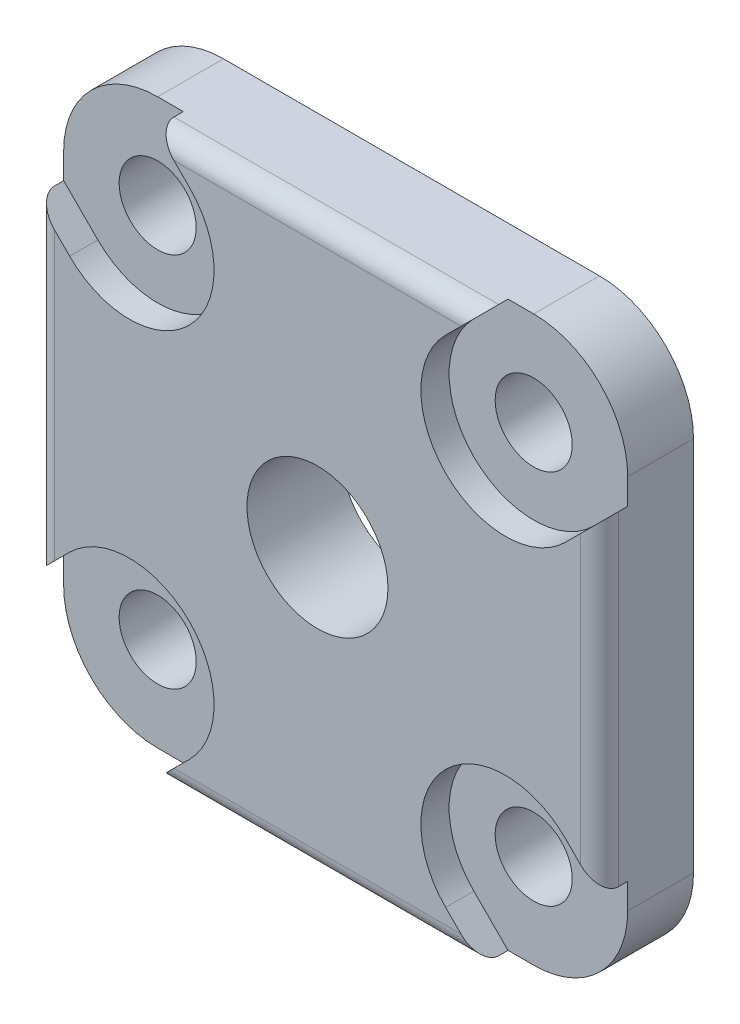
ISO-10303-21;
HEADER;
FILE_DESCRIPTION(('STEP AP214'),'2;1');
FILE_NAME('part.step','',(''),(''),'','','');
FILE_SCHEMA(('AUTOMOTIVE_DESIGN { 1 0 10303 214 1 1 1 1 }'));
ENDSEC;
DATA;
#1=APPLICATION_CONTEXT('core data for automotive mechanical design processes');
#2=APPLICATION_PROTOCOL_DEFINITION('international standard','automotive_design',2000,#1);
#3=PRODUCT_CONTEXT('',#1,'mechanical');
#4=PRODUCT('Part','Part','',(#3));
#5=PRODUCT_RELATED_PRODUCT_CATEGORY('part','',(#4));
#6=PRODUCT_DEFINITION_FORMATION('','',#4);
#7=PRODUCT_DEFINITION_CONTEXT('part definition',#1,'design');
#8=PRODUCT_DEFINITION('design','',#6,#7);
#9=PRODUCT_DEFINITION_SHAPE('','',#8);
#10=(LENGTH_UNIT() NAMED_UNIT(*) SI_UNIT(.MILLI.,.METRE.));
#11=(NAMED_UNIT(*) PLANE_ANGLE_UNIT() SI_UNIT($,.RADIAN.));
#12=(NAMED_UNIT(*) SI_UNIT($,.STERADIAN.) SOLID_ANGLE_UNIT());
#13=UNCERTAINTY_MEASURE_WITH_UNIT(LENGTH_MEASURE(1.E-05),#10,'distance_accuracy_value','');
#14=(GEOMETRIC_REPRESENTATION_CONTEXT(3) GLOBAL_UNCERTAINTY_ASSIGNED_CONTEXT((#13)) GLOBAL_UNIT_ASSIGNED_CONTEXT((#10,
#11,#12)) REPRESENTATION_CONTEXT('',''));
#15=CARTESIAN_POINT('',(0.,0.,0.));
#16=DIRECTION('',(0.,0.,1.));
#17=DIRECTION('',(1.,0.,0.));
#18=AXIS2_PLACEMENT_3D('',#15,#16,#17);
#19=CARTESIAN_POINT('',(-19.9999999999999,-30.,5.));
#20=DIRECTION('',(0.,1.,0.));
#21=DIRECTION('',(0.,0.,1.));
#22=AXIS2_PLACEMENT_3D('',#19,#20,#21);
#23=PLANE('',#22);
#24=DIRECTION('',(0.,0.,1.));
#25=VECTOR('',#24,1.);
#26=CARTESIAN_POINT('',(17.2720779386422,-30.,2.));
#27=LINE('',#26,#25);
#28=CARTESIAN_POINT('',(17.2720779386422,-30.,2.));
#29=VERTEX_POINT('',#28);
#30=CARTESIAN_POINT('',(17.2720779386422,-30.,3.));
#31=VERTEX_POINT('',#30);
#32=EDGE_CURVE('E888',#29,#31,#27,.T.);
#33=ORIENTED_EDGE('',*,*,#32,.T.);
#34=DIRECTION('',(1.,0.,0.));
#35=VECTOR('',#34,1.);
#36=CARTESIAN_POINT('',(-17.2720779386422,-30.,3.));
#37=LINE('',#36,#35);
#38=CARTESIAN_POINT('',(-17.2720779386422,-30.,3.));
#39=VERTEX_POINT('',#38);
#40=EDGE_CURVE('E1012',#31,#39,#37,.F.);
#41=ORIENTED_EDGE('',*,*,#40,.T.);
#42=DIRECTION('',(0.,0.,1.));
#43=VECTOR('',#42,1.);
#44=CARTESIAN_POINT('',(-17.2720779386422,-30.,2.));
#45=LINE('',#44,#43);
#46=CARTESIAN_POINT('',(-17.2720779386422,-30.,2.));
#47=VERTEX_POINT('',#46);
#48=EDGE_CURVE('E812',#47,#39,#45,.T.);
#49=ORIENTED_EDGE('',*,*,#48,.F.);
#50=DIRECTION('',(-1.,0.,0.));
#51=VECTOR('',#50,1.);
#52=CARTESIAN_POINT('',(-19.9999999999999,-30.,2.));
#53=LINE('',#52,#51);
#54=CARTESIAN_POINT('',(-19.9999999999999,-30.,2.));
#55=VERTEX_POINT('',#54);
#56=EDGE_CURVE('E803',#47,#55,#53,.T.);
#57=ORIENTED_EDGE('',*,*,#56,.T.);
#58=DIRECTION('',(0.,0.,-1.));
#59=VECTOR('',#58,1.);
#60=CARTESIAN_POINT('',(-19.9999999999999,-30.,5.));
#61=LINE('',#60,#59);
#62=CARTESIAN_POINT('',(-19.9999999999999,-30.,-5.));
#63=VERTEX_POINT('',#62);
#64=EDGE_CURVE('E982',#55,#63,#61,.T.);
#65=ORIENTED_EDGE('',*,*,#64,.T.);
#66=DIRECTION('',(1.,0.,0.));
#67=VECTOR('',#66,1.);
#68=CARTESIAN_POINT('',(-19.9999999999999,-30.,-5.));
#69=LINE('',#68,#67);
#70=CARTESIAN_POINT('',(19.9999999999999,-30.,-5.));
#71=VERTEX_POINT('',#70);
#72=EDGE_CURVE('E947',#63,#71,#69,.T.);
#73=ORIENTED_EDGE('',*,*,#72,.T.);
#74=DIRECTION('',(0.,0.,-1.));
#75=VECTOR('',#74,1.);
#76=CARTESIAN_POINT('',(19.9999999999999,-30.,5.));
#77=LINE('',#76,#75);
#78=CARTESIAN_POINT('',(19.9999999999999,-30.,2.));
#79=VERTEX_POINT('',#78);
#80=EDGE_CURVE('E980',#79,#71,#77,.T.);
#81=ORIENTED_EDGE('',*,*,#80,.F.);
#82=DIRECTION('',(1.,0.,0.));
#83=VECTOR('',#82,1.);
#84=CARTESIAN_POINT('',(19.9999999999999,-30.,2.));
#85=LINE('',#84,#83);
#86=EDGE_CURVE('E862',#29,#79,#85,.T.);
#87=ORIENTED_EDGE('',*,*,#86,.F.);
#88=EDGE_LOOP('',(#33,#41,#49,#57,#65,#73,#81,#87));
#89=FACE_BOUND('',#88,.T.);
#90=ADVANCED_FACE('F592',(#89),#23,.F.);
#91=CARTESIAN_POINT('',(-30.,19.9999999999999,5.));
#92=DIRECTION('',(1.,0.,0.));
#93=DIRECTION('',(0.,1.,0.));
#94=AXIS2_PLACEMENT_3D('',#91,#92,#93);
#95=PLANE('',#94);
#96=DIRECTION('',(0.,0.,1.));
#97=VECTOR('',#96,1.);
#98=CARTESIAN_POINT('',(-30.,-17.2720779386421,2.));
#99=LINE('',#98,#97);
#100=CARTESIAN_POINT('',(-30.,-17.2720779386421,2.));
#101=VERTEX_POINT('',#100);
#102=CARTESIAN_POINT('',(-30.,-17.2720779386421,3.));
#103=VERTEX_POINT('',#102);
#104=EDGE_CURVE('E783',#101,#103,#99,.T.);
#105=ORIENTED_EDGE('',*,*,#104,.T.);
#106=DIRECTION('',(0.,-1.,0.));
#107=VECTOR('',#106,1.);
#108=CARTESIAN_POINT('',(-30.,17.2720779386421,3.));
#109=LINE('',#108,#107);
#110=CARTESIAN_POINT('',(-30.,17.2720779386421,3.));
#111=VERTEX_POINT('',#110);
#112=EDGE_CURVE('E1006',#103,#111,#109,.F.);
#113=ORIENTED_EDGE('',*,*,#112,.T.);
#114=DIRECTION('',(0.,0.,1.));
#115=VECTOR('',#114,1.);
#116=CARTESIAN_POINT('',(-30.,17.2720779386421,2.));
#117=LINE('',#116,#115);
#118=CARTESIAN_POINT('',(-30.,17.2720779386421,2.));
#119=VERTEX_POINT('',#118);
#120=EDGE_CURVE('E840',#119,#111,#117,.T.);
#121=ORIENTED_EDGE('',*,*,#120,.F.);
#122=DIRECTION('',(0.,-1.,0.));
#123=VECTOR('',#122,1.);
#124=CARTESIAN_POINT('',(-30.,17.2720779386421,2.));
#125=LINE('',#124,#123);
#126=CARTESIAN_POINT('',(-30.,19.9999999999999,2.));
#127=VERTEX_POINT('',#126);
#128=EDGE_CURVE('E824',#127,#119,#125,.T.);
#129=ORIENTED_EDGE('',*,*,#128,.F.);
#130=DIRECTION('',(0.,0.,-1.));
#131=VECTOR('',#130,1.);
#132=CARTESIAN_POINT('',(-30.,19.9999999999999,5.));
#133=LINE('',#132,#131);
#134=CARTESIAN_POINT('',(-30.,19.9999999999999,-5.));
#135=VERTEX_POINT('',#134);
#136=EDGE_CURVE('E970',#127,#135,#133,.T.);
#137=ORIENTED_EDGE('',*,*,#136,.T.);
#138=DIRECTION('',(0.,-1.,0.));
#139=VECTOR('',#138,1.);
#140=CARTESIAN_POINT('',(-30.,19.9999999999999,-5.));
#141=LINE('',#140,#139);
#142=CARTESIAN_POINT('',(-30.,-19.9999999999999,-5.));
#143=VERTEX_POINT('',#142);
#144=EDGE_CURVE('E965',#135,#143,#141,.T.);
#145=ORIENTED_EDGE('',*,*,#144,.T.);
#146=DIRECTION('',(0.,0.,-1.));
#147=VECTOR('',#146,1.);
#148=CARTESIAN_POINT('',(-30.,-19.9999999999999,5.));
#149=LINE('',#148,#147);
#150=CARTESIAN_POINT('',(-30.,-19.9999999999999,2.));
#151=VERTEX_POINT('',#150);
#152=EDGE_CURVE('E968',#151,#143,#149,.T.);
#153=ORIENTED_EDGE('',*,*,#152,.F.);
#154=DIRECTION('',(0.,1.,0.));
#155=VECTOR('',#154,1.);
#156=CARTESIAN_POINT('',(-30.,-17.2720779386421,2.));
#157=LINE('',#156,#155);
#158=EDGE_CURVE('E788',#151,#101,#157,.T.);
#159=ORIENTED_EDGE('',*,*,#158,.T.);
#160=EDGE_LOOP('',(#105,#113,#121,#129,#137,#145,#153,#159));
#161=FACE_BOUND('',#160,.T.);
#162=ADVANCED_FACE('F1077',(#161),#95,.F.);
#163=CARTESIAN_POINT('',(30.,19.9999999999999,5.));
#164=DIRECTION('',(-1.,0.,0.));
#165=DIRECTION('',(0.,-1.,0.));
#166=AXIS2_PLACEMENT_3D('',#163,#164,#165);
#167=PLANE('',#166);
#168=DIRECTION('',(0.,0.,1.));
#169=VECTOR('',#168,1.);
#170=CARTESIAN_POINT('',(30.,17.2720779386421,2.));
#171=LINE('',#170,#169);
#172=CARTESIAN_POINT('',(30.,17.2720779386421,2.));
#173=VERTEX_POINT('',#172);
#174=CARTESIAN_POINT('',(30.,17.2720779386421,3.));
#175=VERTEX_POINT('',#174);
#176=EDGE_CURVE('E922',#173,#175,#171,.T.);
#177=ORIENTED_EDGE('',*,*,#176,.T.);
#178=DIRECTION('',(0.,1.,0.));
#179=VECTOR('',#178,1.);
#180=CARTESIAN_POINT('',(30.,-17.2720779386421,3.));
#181=LINE('',#180,#179);
#182=CARTESIAN_POINT('',(30.,-17.2720779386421,3.));
#183=VERTEX_POINT('',#182);
#184=EDGE_CURVE('E1018',#175,#183,#181,.F.);
#185=ORIENTED_EDGE('',*,*,#184,.T.);
#186=DIRECTION('',(0.,0.,1.));
#187=VECTOR('',#186,1.);
#188=CARTESIAN_POINT('',(30.,-17.2720779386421,2.));
#189=LINE('',#188,#187);
#190=CARTESIAN_POINT('',(30.,-17.2720779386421,2.));
#191=VERTEX_POINT('',#190);
#192=EDGE_CURVE('E873',#191,#183,#189,.T.);
#193=ORIENTED_EDGE('',*,*,#192,.F.);
#194=DIRECTION('',(0.,1.,0.));
#195=VECTOR('',#194,1.);
#196=CARTESIAN_POINT('',(30.,-17.2720779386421,2.));
#197=LINE('',#196,#195);
#198=CARTESIAN_POINT('',(30.,-19.9999999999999,2.));
#199=VERTEX_POINT('',#198);
#200=EDGE_CURVE('E857',#199,#191,#197,.T.);
#201=ORIENTED_EDGE('',*,*,#200,.F.);
#202=DIRECTION('',(0.,0.,-1.));
#203=VECTOR('',#202,1.);
#204=CARTESIAN_POINT('',(30.,-19.9999999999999,5.));
#205=LINE('',#204,#203);
#206=CARTESIAN_POINT('',(30.,-19.9999999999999,-5.));
#207=VERTEX_POINT('',#206);
#208=EDGE_CURVE('E978',#199,#207,#205,.T.);
#209=ORIENTED_EDGE('',*,*,#208,.T.);
#210=DIRECTION('',(0.,1.,0.));
#211=VECTOR('',#210,1.);
#212=CARTESIAN_POINT('',(30.,19.9999999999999,-5.));
#213=LINE('',#212,#211);
#214=CARTESIAN_POINT('',(30.,19.9999999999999,-5.));
#215=VERTEX_POINT('',#214);
#216=EDGE_CURVE('E953',#207,#215,#213,.T.);
#217=ORIENTED_EDGE('',*,*,#216,.T.);
#218=DIRECTION('',(0.,0.,-1.));
#219=VECTOR('',#218,1.);
#220=CARTESIAN_POINT('',(30.,19.9999999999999,5.));
#221=LINE('',#220,#219);
#222=CARTESIAN_POINT('',(30.,19.9999999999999,2.));
#223=VERTEX_POINT('',#222);
#224=EDGE_CURVE('E976',#223,#215,#221,.T.);
#225=ORIENTED_EDGE('',*,*,#224,.F.);
#226=DIRECTION('',(0.,-1.,0.));
#227=VECTOR('',#226,1.);
#228=CARTESIAN_POINT('',(30.,17.2720779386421,2.));
#229=LINE('',#228,#227);
#230=EDGE_CURVE('E892',#223,#173,#229,.T.);
#231=ORIENTED_EDGE('',*,*,#230,.T.);
#232=EDGE_LOOP('',(#177,#185,#193,#201,#209,#217,#225,#231));
#233=FACE_BOUND('',#232,.T.);
#234=ADVANCED_FACE('F1043',(#233),#167,.F.);
#235=CARTESIAN_POINT('',(-19.9999999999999,30.,5.));
#236=DIRECTION('',(0.,-1.,0.));
#237=DIRECTION('',(0.,0.,-1.));
#238=AXIS2_PLACEMENT_3D('',#235,#236,#237);
#239=PLANE('',#238);
#240=DIRECTION('',(0.,0.,1.));
#241=VECTOR('',#240,1.);
#242=CARTESIAN_POINT('',(-17.2720779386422,30.,2.));
#243=LINE('',#242,#241);
#244=CARTESIAN_POINT('',(-17.2720779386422,30.,2.));
#245=VERTEX_POINT('',#244);
#246=CARTESIAN_POINT('',(-17.2720779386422,30.,3.));
#247=VERTEX_POINT('',#246);
#248=EDGE_CURVE('E854',#245,#247,#243,.T.);
#249=ORIENTED_EDGE('',*,*,#248,.T.);
#250=DIRECTION('',(-1.,0.,0.));
#251=VECTOR('',#250,1.);
#252=CARTESIAN_POINT('',(17.2720779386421,30.,3.));
#253=LINE('',#252,#251);
#254=CARTESIAN_POINT('',(17.2720779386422,30.,3.));
#255=VERTEX_POINT('',#254);
#256=EDGE_CURVE('E600',#247,#255,#253,.F.);
#257=ORIENTED_EDGE('',*,*,#256,.T.);
#258=DIRECTION('',(0.,0.,1.));
#259=VECTOR('',#258,1.);
#260=CARTESIAN_POINT('',(17.2720779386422,30.,2.));
#261=LINE('',#260,#259);
#262=CARTESIAN_POINT('',(17.2720779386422,30.,2.));
#263=VERTEX_POINT('',#262);
#264=EDGE_CURVE('E908',#263,#255,#261,.T.);
#265=ORIENTED_EDGE('',*,*,#264,.F.);
#266=DIRECTION('',(1.,0.,0.));
#267=VECTOR('',#266,1.);
#268=CARTESIAN_POINT('',(19.9999999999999,30.,2.));
#269=LINE('',#268,#267);
#270=CARTESIAN_POINT('',(19.9999999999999,30.,2.));
#271=VERTEX_POINT('',#270);
#272=EDGE_CURVE('E902',#263,#271,#269,.T.);
#273=ORIENTED_EDGE('',*,*,#272,.T.);
#274=DIRECTION('',(0.,0.,-1.));
#275=VECTOR('',#274,1.);
#276=CARTESIAN_POINT('',(19.9999999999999,30.,5.));
#277=LINE('',#276,#275);
#278=CARTESIAN_POINT('',(19.9999999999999,30.,-5.));
#279=VERTEX_POINT('',#278);
#280=EDGE_CURVE('E974',#271,#279,#277,.T.);
#281=ORIENTED_EDGE('',*,*,#280,.T.);
#282=DIRECTION('',(-1.,0.,0.));
#283=VECTOR('',#282,1.);
#284=CARTESIAN_POINT('',(-19.9999999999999,30.,-5.));
#285=LINE('',#284,#283);
#286=CARTESIAN_POINT('',(-19.9999999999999,30.,-5.));
#287=VERTEX_POINT('',#286);
#288=EDGE_CURVE('E959',#279,#287,#285,.T.);
#289=ORIENTED_EDGE('',*,*,#288,.T.);
#290=DIRECTION('',(0.,0.,-1.));
#291=VECTOR('',#290,1.);
#292=CARTESIAN_POINT('',(-19.9999999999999,30.,5.));
#293=LINE('',#292,#291);
#294=CARTESIAN_POINT('',(-19.9999999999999,30.,2.));
#295=VERTEX_POINT('',#294);
#296=EDGE_CURVE('E972',#295,#287,#293,.T.);
#297=ORIENTED_EDGE('',*,*,#296,.F.);
#298=DIRECTION('',(-1.,0.,0.));
#299=VECTOR('',#298,1.);
#300=CARTESIAN_POINT('',(-19.9999999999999,30.,2.));
#301=LINE('',#300,#299);
#302=EDGE_CURVE('E829',#245,#295,#301,.T.);
#303=ORIENTED_EDGE('',*,*,#302,.F.);
#304=EDGE_LOOP('',(#249,#257,#265,#273,#281,#289,#297,#303));
#305=FACE_BOUND('',#304,.T.);
#306=ADVANCED_FACE('F1055',(#305),#239,.F.);
#307=CARTESIAN_POINT('',(-20.,-20.,5.));
#308=DIRECTION('',(0.,0.,1.));
#309=DIRECTION('',(1.,0.,0.));
#310=AXIS2_PLACEMENT_3D('',#307,#308,#309);
#311=PLANE('',#310);
#312=DIRECTION('',(0.707106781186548,-0.707106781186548,0.));
#313=VECTOR('',#312,1.);
#314=CARTESIAN_POINT('',(-30.,17.2720779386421,5.));
#315=LINE('',#314,#313);
#316=CARTESIAN_POINT('',(-28.,15.2720779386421,5.));
#317=VERTEX_POINT('',#316);
#318=CARTESIAN_POINT('',(-26.3639610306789,13.6360389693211,5.));
#319=VERTEX_POINT('',#318);
#320=EDGE_CURVE('E827',#317,#319,#315,.T.);
#321=ORIENTED_EDGE('',*,*,#320,.F.);
#322=DIRECTION('',(0.,-1.,0.));
#323=VECTOR('',#322,1.);
#324=CARTESIAN_POINT('',(-28.,-17.2720779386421,5.));
#325=LINE('',#324,#323);
#326=CARTESIAN_POINT('',(-28.,-15.2720779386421,5.));
#327=VERTEX_POINT('',#326);
#328=EDGE_CURVE('E1001',#317,#327,#325,.T.);
#329=ORIENTED_EDGE('',*,*,#328,.T.);
#330=DIRECTION('',(0.707106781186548,0.707106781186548,0.));
#331=VECTOR('',#330,1.);
#332=CARTESIAN_POINT('',(-30.,-17.2720779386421,5.));
#333=LINE('',#332,#331);
#334=CARTESIAN_POINT('',(-26.3639610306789,-13.6360389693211,5.));
#335=VERTEX_POINT('',#334);
#336=EDGE_CURVE('E813',#327,#335,#333,.T.);
#337=ORIENTED_EDGE('',*,*,#336,.T.);
#338=CARTESIAN_POINT('',(-20.,-20.,5.));
#339=DIRECTION('',(0.,0.,-1.));
#340=DIRECTION('',(1.,0.,0.));
#341=AXIS2_PLACEMENT_3D('',#338,#339,#340);
#342=CIRCLE('',#341,9.00000000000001);
#343=CARTESIAN_POINT('',(-13.6360389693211,-26.3639610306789,5.));
#344=VERTEX_POINT('',#343);
#345=EDGE_CURVE('E794',#335,#344,#342,.T.);
#346=ORIENTED_EDGE('',*,*,#345,.T.);
#347=DIRECTION('',(-0.707106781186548,-0.707106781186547,0.));
#348=VECTOR('',#347,1.);
#349=CARTESIAN_POINT('',(-13.6360389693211,-26.3639610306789,5.));
#350=LINE('',#349,#348);
#351=CARTESIAN_POINT('',(-15.2720779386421,-28.,5.));
#352=VERTEX_POINT('',#351);
#353=EDGE_CURVE('E816',#344,#352,#350,.T.);
#354=ORIENTED_EDGE('',*,*,#353,.T.);
#355=DIRECTION('',(1.,0.,0.));
#356=VECTOR('',#355,1.);
#357=CARTESIAN_POINT('',(17.2720779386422,-28.,5.));
#358=LINE('',#357,#356);
#359=CARTESIAN_POINT('',(15.2720779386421,-28.,5.));
#360=VERTEX_POINT('',#359);
#361=EDGE_CURVE('E998',#352,#360,#358,.T.);
#362=ORIENTED_EDGE('',*,*,#361,.T.);
#363=DIRECTION('',(0.707106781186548,-0.707106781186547,0.));
#364=VECTOR('',#363,1.);
#365=CARTESIAN_POINT('',(13.6360389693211,-26.3639610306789,5.));
#366=LINE('',#365,#364);
#367=CARTESIAN_POINT('',(13.6360389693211,-26.3639610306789,5.));
#368=VERTEX_POINT('',#367);
#369=EDGE_CURVE('E874',#368,#360,#366,.T.);
#370=ORIENTED_EDGE('',*,*,#369,.F.);
#371=CARTESIAN_POINT('',(20.,-20.,5.));
#372=DIRECTION('',(0.,0.,1.));
#373=DIRECTION('',(-1.,0.,0.));
#374=AXIS2_PLACEMENT_3D('',#371,#372,#373);
#375=CIRCLE('',#374,9.00000000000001);
#376=CARTESIAN_POINT('',(26.3639610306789,-13.6360389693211,5.));
#377=VERTEX_POINT('',#376);
#378=EDGE_CURVE('E877',#377,#368,#375,.T.);
#379=ORIENTED_EDGE('',*,*,#378,.F.);
#380=DIRECTION('',(-0.707106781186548,0.707106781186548,0.));
#381=VECTOR('',#380,1.);
#382=CARTESIAN_POINT('',(30.,-17.2720779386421,5.));
#383=LINE('',#382,#381);
#384=CARTESIAN_POINT('',(28.,-15.2720779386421,5.));
#385=VERTEX_POINT('',#384);
#386=EDGE_CURVE('E860',#385,#377,#383,.T.);
#387=ORIENTED_EDGE('',*,*,#386,.F.);
#388=DIRECTION('',(0.,1.,0.));
#389=VECTOR('',#388,1.);
#390=CARTESIAN_POINT('',(28.,17.2720779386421,5.));
#391=LINE('',#390,#389);
#392=CARTESIAN_POINT('',(28.,15.2720779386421,5.));
#393=VERTEX_POINT('',#392);
#394=EDGE_CURVE('E995',#385,#393,#391,.T.);
#395=ORIENTED_EDGE('',*,*,#394,.T.);
#396=DIRECTION('',(-0.707106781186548,-0.707106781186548,0.));
#397=VECTOR('',#396,1.);
#398=CARTESIAN_POINT('',(30.,17.2720779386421,5.));
#399=LINE('',#398,#397);
#400=CARTESIAN_POINT('',(26.3639610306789,13.6360389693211,5.));
#401=VERTEX_POINT('',#400);
#402=EDGE_CURVE('E909',#393,#401,#399,.T.);
#403=ORIENTED_EDGE('',*,*,#402,.T.);
#404=CARTESIAN_POINT('',(20.,20.,5.));
#405=DIRECTION('',(0.,0.,-1.));
#406=DIRECTION('',(-1.,0.,0.));
#407=AXIS2_PLACEMENT_3D('',#404,#405,#406);
#408=CIRCLE('',#407,9.00000000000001);
#409=CARTESIAN_POINT('',(13.6360389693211,26.3639610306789,5.));
#410=VERTEX_POINT('',#409);
#411=EDGE_CURVE('E911',#401,#410,#408,.T.);
#412=ORIENTED_EDGE('',*,*,#411,.T.);
#413=DIRECTION('',(0.707106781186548,0.707106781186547,0.));
#414=VECTOR('',#413,1.);
#415=CARTESIAN_POINT('',(13.6360389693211,26.3639610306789,5.));
#416=LINE('',#415,#414);
#417=CARTESIAN_POINT('',(15.2720779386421,28.,5.));
#418=VERTEX_POINT('',#417);
#419=EDGE_CURVE('E896',#410,#418,#416,.T.);
#420=ORIENTED_EDGE('',*,*,#419,.T.);
#421=DIRECTION('',(-1.,0.,0.));
#422=VECTOR('',#421,1.);
#423=CARTESIAN_POINT('',(-17.2720779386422,28.,5.));
#424=LINE('',#423,#422);
#425=CARTESIAN_POINT('',(-15.2720779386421,28.,5.));
#426=VERTEX_POINT('',#425);
#427=EDGE_CURVE('E984',#418,#426,#424,.T.);
#428=ORIENTED_EDGE('',*,*,#427,.T.);
#429=DIRECTION('',(-0.707106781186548,0.707106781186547,0.));
#430=VECTOR('',#429,1.);
#431=CARTESIAN_POINT('',(-13.6360389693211,26.3639610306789,5.));
#432=LINE('',#431,#430);
#433=CARTESIAN_POINT('',(-13.6360389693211,26.3639610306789,5.));
#434=VERTEX_POINT('',#433);
#435=EDGE_CURVE('E841',#434,#426,#432,.T.);
#436=ORIENTED_EDGE('',*,*,#435,.F.);
#437=CARTESIAN_POINT('',(-20.,20.,5.));
#438=DIRECTION('',(0.,0.,1.));
#439=DIRECTION('',(1.,0.,0.));
#440=AXIS2_PLACEMENT_3D('',#437,#438,#439);
#441=CIRCLE('',#440,9.00000000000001);
#442=EDGE_CURVE('E843',#319,#434,#441,.T.);
#443=ORIENTED_EDGE('',*,*,#442,.F.);
#444=EDGE_LOOP('',(#321,#329,#337,#346,#354,#362,#370,#379,#387,#395,#403,#412,#420,#428,#436,#443));
#445=FACE_BOUND('',#444,.T.);
#446=CARTESIAN_POINT('',(0.,0.,5.));
#447=DIRECTION('',(0.,0.,1.));
#448=DIRECTION('',(1.,0.,0.));
#449=AXIS2_PLACEMENT_3D('',#446,#447,#448);
#450=CIRCLE('',#449,7.5);
#451=CARTESIAN_POINT('',(7.5,0.,5.));
#452=VERTEX_POINT('',#451);
#453=EDGE_CURVE('E938',#452,#452,#450,.T.);
#454=ORIENTED_EDGE('',*,*,#453,.F.);
#455=EDGE_LOOP('',(#454));
#456=FACE_BOUND('',#455,.T.);
#457=ADVANCED_FACE('F1034',(#445,#456),#311,.T.);
#458=CARTESIAN_POINT('',(-20.,-20.,5.));
#459=DIRECTION('',(0.,0.,-1.));
#460=DIRECTION('',(-1.,0.,0.));
#461=AXIS2_PLACEMENT_3D('',#458,#459,#460);
#462=CYLINDRICAL_SURFACE('',#461,10.);
#463=ORIENTED_EDGE('',*,*,#64,.F.);
#464=CARTESIAN_POINT('',(-20.,-20.,2.));
#465=DIRECTION('',(0.,0.,-1.));
#466=DIRECTION('',(1.,0.,0.));
#467=AXIS2_PLACEMENT_3D('',#464,#465,#466);
#468=CIRCLE('',#467,10.);
#469=EDGE_CURVE('E809',#55,#151,#468,.T.);
#470=ORIENTED_EDGE('',*,*,#469,.T.);
#471=ORIENTED_EDGE('',*,*,#152,.T.);
#472=CARTESIAN_POINT('',(-20.,-20.,-5.));
#473=DIRECTION('',(0.,0.,1.));
#474=DIRECTION('',(1.,0.,0.));
#475=AXIS2_PLACEMENT_3D('',#472,#473,#474);
#476=CIRCLE('',#475,10.);
#477=EDGE_CURVE('E942',#143,#63,#476,.T.);
#478=ORIENTED_EDGE('',*,*,#477,.T.);
#479=EDGE_LOOP('',(#463,#470,#471,#478));
#480=FACE_BOUND('',#479,.T.);
#481=ADVANCED_FACE('F1089',(#480),#462,.T.);
#482=CARTESIAN_POINT('',(20.,-20.,5.));
#483=DIRECTION('',(0.,0.,-1.));
#484=DIRECTION('',(-1.,0.,0.));
#485=AXIS2_PLACEMENT_3D('',#482,#483,#484);
#486=CYLINDRICAL_SURFACE('',#485,10.);
#487=ORIENTED_EDGE('',*,*,#208,.F.);
#488=CARTESIAN_POINT('',(20.,-20.,2.));
#489=DIRECTION('',(0.,0.,1.));
#490=DIRECTION('',(-1.,0.,0.));
#491=AXIS2_PLACEMENT_3D('',#488,#489,#490);
#492=CIRCLE('',#491,10.);
#493=EDGE_CURVE('E859',#79,#199,#492,.T.);
#494=ORIENTED_EDGE('',*,*,#493,.F.);
#495=ORIENTED_EDGE('',*,*,#80,.T.);
#496=CARTESIAN_POINT('',(20.,-20.,-5.));
#497=DIRECTION('',(0.,0.,1.));
#498=DIRECTION('',(-1.,0.,0.));
#499=AXIS2_PLACEMENT_3D('',#496,#497,#498);
#500=CIRCLE('',#499,10.);
#501=EDGE_CURVE('E950',#71,#207,#500,.T.);
#502=ORIENTED_EDGE('',*,*,#501,.T.);
#503=EDGE_LOOP('',(#487,#494,#495,#502));
#504=FACE_BOUND('',#503,.T.);
#505=ADVANCED_FACE('F1087',(#504),#486,.T.);
#506=CARTESIAN_POINT('',(20.,20.,5.));
#507=DIRECTION('',(0.,0.,-1.));
#508=DIRECTION('',(-1.,0.,0.));
#509=AXIS2_PLACEMENT_3D('',#506,#507,#508);
#510=CYLINDRICAL_SURFACE('',#509,10.);
#511=ORIENTED_EDGE('',*,*,#280,.F.);
#512=CARTESIAN_POINT('',(20.,20.,2.));
#513=DIRECTION('',(0.,0.,-1.));
#514=DIRECTION('',(-1.,0.,0.));
#515=AXIS2_PLACEMENT_3D('',#512,#513,#514);
#516=CIRCLE('',#515,10.);
#517=EDGE_CURVE('E905',#271,#223,#516,.T.);
#518=ORIENTED_EDGE('',*,*,#517,.T.);
#519=ORIENTED_EDGE('',*,*,#224,.T.);
#520=CARTESIAN_POINT('',(20.,20.,-5.));
#521=DIRECTION('',(0.,0.,1.));
#522=DIRECTION('',(1.,0.,0.));
#523=AXIS2_PLACEMENT_3D('',#520,#521,#522);
#524=CIRCLE('',#523,10.);
#525=EDGE_CURVE('E956',#215,#279,#524,.T.);
#526=ORIENTED_EDGE('',*,*,#525,.T.);
#527=EDGE_LOOP('',(#511,#518,#519,#526));
#528=FACE_BOUND('',#527,.T.);
#529=ADVANCED_FACE('F1052',(#528),#510,.T.);
#530=CARTESIAN_POINT('',(-20.,20.,5.));
#531=DIRECTION('',(0.,0.,-1.));
#532=DIRECTION('',(-1.,0.,0.));
#533=AXIS2_PLACEMENT_3D('',#530,#531,#532);
#534=CYLINDRICAL_SURFACE('',#533,10.);
#535=ORIENTED_EDGE('',*,*,#136,.F.);
#536=CARTESIAN_POINT('',(-20.,20.,2.));
#537=DIRECTION('',(0.,0.,1.));
#538=DIRECTION('',(1.,0.,0.));
#539=AXIS2_PLACEMENT_3D('',#536,#537,#538);
#540=CIRCLE('',#539,10.);
#541=EDGE_CURVE('E826',#295,#127,#540,.T.);
#542=ORIENTED_EDGE('',*,*,#541,.F.);
#543=ORIENTED_EDGE('',*,*,#296,.T.);
#544=CARTESIAN_POINT('',(-20.,20.,-5.));
#545=DIRECTION('',(0.,0.,1.));
#546=DIRECTION('',(-1.,0.,0.));
#547=AXIS2_PLACEMENT_3D('',#544,#545,#546);
#548=CIRCLE('',#547,10.);
#549=EDGE_CURVE('E962',#287,#135,#548,.T.);
#550=ORIENTED_EDGE('',*,*,#549,.T.);
#551=EDGE_LOOP('',(#535,#542,#543,#550));
#552=FACE_BOUND('',#551,.T.);
#553=ADVANCED_FACE('F1126',(#552),#534,.T.);
#554=CARTESIAN_POINT('',(-20.,-20.,-5.));
#555=DIRECTION('',(0.,0.,1.));
#556=DIRECTION('',(1.,0.,0.));
#557=AXIS2_PLACEMENT_3D('',#554,#555,#556);
#558=PLANE('',#557);
#559=CARTESIAN_POINT('',(20.,20.,-5.));
#560=DIRECTION('',(0.,0.,-1.));
#561=DIRECTION('',(-1.,0.,0.));
#562=AXIS2_PLACEMENT_3D('',#559,#560,#561);
#563=CIRCLE('',#562,4.1);
#564=CARTESIAN_POINT('',(15.9,20.,-5.));
#565=VERTEX_POINT('',#564);
#566=EDGE_CURVE('E926',#565,#565,#563,.T.);
#567=ORIENTED_EDGE('',*,*,#566,.F.);
#568=EDGE_LOOP('',(#567));
#569=FACE_BOUND('',#568,.T.);
#570=CARTESIAN_POINT('',(-20.,20.,-5.));
#571=DIRECTION('',(0.,0.,-1.));
#572=DIRECTION('',(-1.,0.,0.));
#573=AXIS2_PLACEMENT_3D('',#570,#571,#572);
#574=CIRCLE('',#573,4.1);
#575=CARTESIAN_POINT('',(-24.1,20.,-5.));
#576=VERTEX_POINT('',#575);
#577=EDGE_CURVE('E929',#576,#576,#574,.T.);
#578=ORIENTED_EDGE('',*,*,#577,.F.);
#579=EDGE_LOOP('',(#578));
#580=FACE_BOUND('',#579,.T.);
#581=CARTESIAN_POINT('',(-20.,-20.,-5.));
#582=DIRECTION('',(0.,0.,-1.));
#583=DIRECTION('',(-1.,0.,0.));
#584=AXIS2_PLACEMENT_3D('',#581,#582,#583);
#585=CIRCLE('',#584,4.1);
#586=CARTESIAN_POINT('',(-24.1,-20.,-5.));
#587=VERTEX_POINT('',#586);
#588=EDGE_CURVE('E932',#587,#587,#585,.T.);
#589=ORIENTED_EDGE('',*,*,#588,.F.);
#590=EDGE_LOOP('',(#589));
#591=FACE_BOUND('',#590,.T.);
#592=CARTESIAN_POINT('',(20.,-20.,-5.));
#593=DIRECTION('',(0.,0.,-1.));
#594=DIRECTION('',(-1.,0.,0.));
#595=AXIS2_PLACEMENT_3D('',#592,#593,#594);
#596=CIRCLE('',#595,4.1);
#597=CARTESIAN_POINT('',(15.9,-20.,-5.));
#598=VERTEX_POINT('',#597);
#599=EDGE_CURVE('E935',#598,#598,#596,.T.);
#600=ORIENTED_EDGE('',*,*,#599,.F.);
#601=EDGE_LOOP('',(#600));
#602=FACE_BOUND('',#601,.T.);
#603=CARTESIAN_POINT('',(0.,0.,-5.));
#604=DIRECTION('',(0.,0.,1.));
#605=DIRECTION('',(1.,0.,0.));
#606=AXIS2_PLACEMENT_3D('',#603,#604,#605);
#607=CIRCLE('',#606,7.5);
#608=CARTESIAN_POINT('',(7.5,0.,-5.));
#609=VERTEX_POINT('',#608);
#610=EDGE_CURVE('E939',#609,#609,#607,.T.);
#611=ORIENTED_EDGE('',*,*,#610,.T.);
#612=EDGE_LOOP('',(#611));
#613=FACE_BOUND('',#612,.T.);
#614=ORIENTED_EDGE('',*,*,#477,.F.);
#615=ORIENTED_EDGE('',*,*,#144,.F.);
#616=ORIENTED_EDGE('',*,*,#549,.F.);
#617=ORIENTED_EDGE('',*,*,#288,.F.);
#618=ORIENTED_EDGE('',*,*,#525,.F.);
#619=ORIENTED_EDGE('',*,*,#216,.F.);
#620=ORIENTED_EDGE('',*,*,#501,.F.);
#621=ORIENTED_EDGE('',*,*,#72,.F.);
#622=EDGE_LOOP('',(#614,#615,#616,#617,#618,#619,#620,#621));
#623=FACE_BOUND('',#622,.T.);
#624=ADVANCED_FACE('F1130',(#569,#580,#591,#602,#613,#623),#558,.F.);
#625=CARTESIAN_POINT('',(0.,0.,-5.));
#626=DIRECTION('',(0.,0.,1.));
#627=DIRECTION('',(1.,0.,0.));
#628=AXIS2_PLACEMENT_3D('',#625,#626,#627);
#629=CYLINDRICAL_SURFACE('',#628,7.5);
#630=ORIENTED_EDGE('',*,*,#610,.F.);
#631=EDGE_LOOP('',(#630));
#632=FACE_BOUND('',#631,.T.);
#633=ORIENTED_EDGE('',*,*,#453,.T.);
#634=EDGE_LOOP('',(#633));
#635=FACE_BOUND('',#634,.T.);
#636=ADVANCED_FACE('F1172',(#632,#635),#629,.F.);
#637=CARTESIAN_POINT('',(20.,-20.,-5.));
#638=DIRECTION('',(0.,0.,-1.));
#639=DIRECTION('',(-1.,0.,0.));
#640=AXIS2_PLACEMENT_3D('',#637,#638,#639);
#641=CYLINDRICAL_SURFACE('',#640,4.1);
#642=CARTESIAN_POINT('',(20.,-20.,2.));
#643=DIRECTION('',(0.,0.,-1.));
#644=DIRECTION('',(-1.,0.,0.));
#645=AXIS2_PLACEMENT_3D('',#642,#643,#644);
#646=CIRCLE('',#645,4.1);
#647=CARTESIAN_POINT('',(15.9,-20.,2.));
#648=VERTEX_POINT('',#647);
#649=EDGE_CURVE('E891',#648,#648,#646,.F.);
#650=ORIENTED_EDGE('',*,*,#649,.T.);
#651=EDGE_LOOP('',(#650));
#652=FACE_BOUND('',#651,.T.);
#653=ORIENTED_EDGE('',*,*,#599,.T.);
#654=EDGE_LOOP('',(#653));
#655=FACE_BOUND('',#654,.T.);
#656=ADVANCED_FACE('F1179',(#652,#655),#641,.F.);
#657=CARTESIAN_POINT('',(-20.,-20.,-5.));
#658=DIRECTION('',(0.,0.,-1.));
#659=DIRECTION('',(-1.,0.,0.));
#660=AXIS2_PLACEMENT_3D('',#657,#658,#659);
#661=CYLINDRICAL_SURFACE('',#660,4.1);
#662=CARTESIAN_POINT('',(-20.,-20.,2.));
#663=DIRECTION('',(0.,0.,-1.));
#664=DIRECTION('',(-1.,0.,0.));
#665=AXIS2_PLACEMENT_3D('',#662,#663,#664);
#666=CIRCLE('',#665,4.1);
#667=CARTESIAN_POINT('',(-24.1,-20.,2.));
#668=VERTEX_POINT('',#667);
#669=EDGE_CURVE('E823',#668,#668,#666,.F.);
#670=ORIENTED_EDGE('',*,*,#669,.T.);
#671=EDGE_LOOP('',(#670));
#672=FACE_BOUND('',#671,.T.);
#673=ORIENTED_EDGE('',*,*,#588,.T.);
#674=EDGE_LOOP('',(#673));
#675=FACE_BOUND('',#674,.T.);
#676=ADVANCED_FACE('F1194',(#672,#675),#661,.F.);
#677=CARTESIAN_POINT('',(-20.,20.,-5.));
#678=DIRECTION('',(0.,0.,-1.));
#679=DIRECTION('',(-1.,0.,0.));
#680=AXIS2_PLACEMENT_3D('',#677,#678,#679);
#681=CYLINDRICAL_SURFACE('',#680,4.1);
#682=CARTESIAN_POINT('',(-20.,20.,2.));
#683=DIRECTION('',(0.,0.,-1.));
#684=DIRECTION('',(-1.,0.,0.));
#685=AXIS2_PLACEMENT_3D('',#682,#683,#684);
#686=CIRCLE('',#685,4.1);
#687=CARTESIAN_POINT('',(-24.1,20.,2.));
#688=VERTEX_POINT('',#687);
#689=EDGE_CURVE('E856',#688,#688,#686,.F.);
#690=ORIENTED_EDGE('',*,*,#689,.T.);
#691=EDGE_LOOP('',(#690));
#692=FACE_BOUND('',#691,.T.);
#693=ORIENTED_EDGE('',*,*,#577,.T.);
#694=EDGE_LOOP('',(#693));
#695=FACE_BOUND('',#694,.T.);
#696=ADVANCED_FACE('F1199',(#692,#695),#681,.F.);
#697=CARTESIAN_POINT('',(20.,20.,-5.));
#698=DIRECTION('',(0.,0.,-1.));
#699=DIRECTION('',(-1.,0.,0.));
#700=AXIS2_PLACEMENT_3D('',#697,#698,#699);
#701=CYLINDRICAL_SURFACE('',#700,4.1);
#702=CARTESIAN_POINT('',(20.,20.,2.));
#703=DIRECTION('',(0.,0.,-1.));
#704=DIRECTION('',(-1.,0.,0.));
#705=AXIS2_PLACEMENT_3D('',#702,#703,#704);
#706=CIRCLE('',#705,4.1);
#707=CARTESIAN_POINT('',(15.9,20.,2.));
#708=VERTEX_POINT('',#707);
#709=EDGE_CURVE('E925',#708,#708,#706,.F.);
#710=ORIENTED_EDGE('',*,*,#709,.T.);
#711=EDGE_LOOP('',(#710));
#712=FACE_BOUND('',#711,.T.);
#713=ORIENTED_EDGE('',*,*,#566,.T.);
#714=EDGE_LOOP('',(#713));
#715=FACE_BOUND('',#714,.T.);
#716=ADVANCED_FACE('F1205',(#712,#715),#701,.F.);
#717=CARTESIAN_POINT('',(20.,20.,2.));
#718=DIRECTION('',(0.,0.,-1.));
#719=DIRECTION('',(-1.,0.,0.));
#720=AXIS2_PLACEMENT_3D('',#717,#718,#719);
#721=PLANE('',#720);
#722=ORIENTED_EDGE('',*,*,#230,.F.);
#723=ORIENTED_EDGE('',*,*,#517,.F.);
#724=ORIENTED_EDGE('',*,*,#272,.F.);
#725=DIRECTION('',(0.707106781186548,0.707106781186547,0.));
#726=VECTOR('',#725,1.);
#727=CARTESIAN_POINT('',(13.6360389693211,26.3639610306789,2.));
#728=LINE('',#727,#726);
#729=CARTESIAN_POINT('',(13.6360389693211,26.3639610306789,2.));
#730=VERTEX_POINT('',#729);
#731=EDGE_CURVE('E900',#730,#263,#728,.T.);
#732=ORIENTED_EDGE('',*,*,#731,.F.);
#733=CARTESIAN_POINT('',(20.,20.,2.));
#734=DIRECTION('',(0.,0.,-1.));
#735=DIRECTION('',(-1.,0.,0.));
#736=AXIS2_PLACEMENT_3D('',#733,#734,#735);
#737=CIRCLE('',#736,9.00000000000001);
#738=CARTESIAN_POINT('',(26.3639610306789,13.6360389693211,2.));
#739=VERTEX_POINT('',#738);
#740=EDGE_CURVE('E898',#739,#730,#737,.T.);
#741=ORIENTED_EDGE('',*,*,#740,.F.);
#742=DIRECTION('',(-0.707106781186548,-0.707106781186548,0.));
#743=VECTOR('',#742,1.);
#744=CARTESIAN_POINT('',(30.,17.2720779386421,2.));
#745=LINE('',#744,#743);
#746=EDGE_CURVE('E895',#173,#739,#745,.T.);
#747=ORIENTED_EDGE('',*,*,#746,.F.);
#748=EDGE_LOOP('',(#722,#723,#724,#732,#741,#747));
#749=FACE_BOUND('',#748,.T.);
#750=ORIENTED_EDGE('',*,*,#709,.F.);
#751=EDGE_LOOP('',(#750));
#752=FACE_BOUND('',#751,.T.);
#753=ADVANCED_FACE('F1046',(#749,#752),#721,.F.);
#754=CARTESIAN_POINT('',(30.,17.2720779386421,2.));
#755=DIRECTION('',(-0.707106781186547,0.707106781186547,0.));
#756=DIRECTION('',(-0.707106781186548,-0.707106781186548,0.));
#757=AXIS2_PLACEMENT_3D('',#754,#755,#756);
#758=PLANE('',#757);
#759=ORIENTED_EDGE('',*,*,#402,.F.);
#760=CARTESIAN_POINT('',(28.,15.2720779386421,3.));
#761=DIRECTION('',(-0.707106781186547,0.707106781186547,0.));
#762=DIRECTION('',(-0.707106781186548,-0.707106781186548,0.));
#763=AXIS2_PLACEMENT_3D('',#760,#761,#762);
#764=ELLIPSE('',#763,2.82842712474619,2.);
#765=EDGE_CURVE('E1016',#393,#175,#764,.T.);
#766=ORIENTED_EDGE('',*,*,#765,.T.);
#767=ORIENTED_EDGE('',*,*,#176,.F.);
#768=ORIENTED_EDGE('',*,*,#746,.T.);
#769=DIRECTION('',(0.,0.,1.));
#770=VECTOR('',#769,1.);
#771=CARTESIAN_POINT('',(26.3639610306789,13.6360389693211,2.));
#772=LINE('',#771,#770);
#773=EDGE_CURVE('E919',#739,#401,#772,.T.);
#774=ORIENTED_EDGE('',*,*,#773,.T.);
#775=EDGE_LOOP('',(#759,#766,#767,#768,#774));
#776=FACE_BOUND('',#775,.T.);
#777=ADVANCED_FACE('F1041',(#776),#758,.T.);
#778=CARTESIAN_POINT('',(20.,20.,2.));
#779=DIRECTION('',(0.,0.,1.));
#780=DIRECTION('',(1.,0.,0.));
#781=AXIS2_PLACEMENT_3D('',#778,#779,#780);
#782=CYLINDRICAL_SURFACE('',#781,9.00000000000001);
#783=ORIENTED_EDGE('',*,*,#411,.F.);
#784=ORIENTED_EDGE('',*,*,#773,.F.);
#785=ORIENTED_EDGE('',*,*,#740,.T.);
#786=DIRECTION('',(0.,0.,1.));
#787=VECTOR('',#786,1.);
#788=CARTESIAN_POINT('',(13.6360389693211,26.3639610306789,2.));
#789=LINE('',#788,#787);
#790=EDGE_CURVE('E917',#730,#410,#789,.T.);
#791=ORIENTED_EDGE('',*,*,#790,.T.);
#792=EDGE_LOOP('',(#783,#784,#785,#791));
#793=FACE_BOUND('',#792,.T.);
#794=ADVANCED_FACE('F1066',(#793),#782,.F.);
#795=CARTESIAN_POINT('',(13.6360389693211,26.3639610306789,2.));
#796=DIRECTION('',(0.707106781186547,-0.707106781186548,0.));
#797=DIRECTION('',(0.707106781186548,0.707106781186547,0.));
#798=AXIS2_PLACEMENT_3D('',#795,#796,#797);
#799=PLANE('',#798);
#800=ORIENTED_EDGE('',*,*,#264,.T.);
#801=CARTESIAN_POINT('',(15.2720779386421,28.,3.));
#802=DIRECTION('',(0.707106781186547,-0.707106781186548,0.));
#803=DIRECTION('',(0.707106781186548,0.707106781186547,0.));
#804=AXIS2_PLACEMENT_3D('',#801,#802,#803);
#805=ELLIPSE('',#804,2.82842712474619,2.);
#806=EDGE_CURVE('E12',#255,#418,#805,.T.);
#807=ORIENTED_EDGE('',*,*,#806,.T.);
#808=ORIENTED_EDGE('',*,*,#419,.F.);
#809=ORIENTED_EDGE('',*,*,#790,.F.);
#810=ORIENTED_EDGE('',*,*,#731,.T.);
#811=EDGE_LOOP('',(#800,#807,#808,#809,#810));
#812=FACE_BOUND('',#811,.T.);
#813=ADVANCED_FACE('F1061',(#812),#799,.T.);
#814=CARTESIAN_POINT('',(20.,-20.,2.));
#815=DIRECTION('',(0.,0.,-1.));
#816=DIRECTION('',(-1.,0.,0.));
#817=AXIS2_PLACEMENT_3D('',#814,#815,#816);
#818=PLANE('',#817);
#819=ORIENTED_EDGE('',*,*,#200,.T.);
#820=DIRECTION('',(-0.707106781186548,0.707106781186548,0.));
#821=VECTOR('',#820,1.);
#822=CARTESIAN_POINT('',(30.,-17.2720779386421,2.));
#823=LINE('',#822,#821);
#824=CARTESIAN_POINT('',(26.3639610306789,-13.6360389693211,2.));
#825=VERTEX_POINT('',#824);
#826=EDGE_CURVE('E870',#191,#825,#823,.T.);
#827=ORIENTED_EDGE('',*,*,#826,.T.);
#828=CARTESIAN_POINT('',(20.,-20.,2.));
#829=DIRECTION('',(0.,0.,1.));
#830=DIRECTION('',(-1.,0.,0.));
#831=AXIS2_PLACEMENT_3D('',#828,#829,#830);
#832=CIRCLE('',#831,9.00000000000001);
#833=CARTESIAN_POINT('',(13.6360389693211,-26.3639610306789,2.));
#834=VERTEX_POINT('',#833);
#835=EDGE_CURVE('E867',#825,#834,#832,.T.);
#836=ORIENTED_EDGE('',*,*,#835,.T.);
#837=DIRECTION('',(0.707106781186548,-0.707106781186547,0.));
#838=VECTOR('',#837,1.);
#839=CARTESIAN_POINT('',(13.6360389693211,-26.3639610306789,2.));
#840=LINE('',#839,#838);
#841=EDGE_CURVE('E864',#834,#29,#840,.T.);
#842=ORIENTED_EDGE('',*,*,#841,.T.);
#843=ORIENTED_EDGE('',*,*,#86,.T.);
#844=ORIENTED_EDGE('',*,*,#493,.T.);
#845=EDGE_LOOP('',(#819,#827,#836,#842,#843,#844));
#846=FACE_BOUND('',#845,.T.);
#847=ORIENTED_EDGE('',*,*,#649,.F.);
#848=EDGE_LOOP('',(#847));
#849=FACE_BOUND('',#848,.T.);
#850=ADVANCED_FACE('F1139',(#846,#849),#818,.F.);
#851=CARTESIAN_POINT('',(13.6360389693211,-26.3639610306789,2.));
#852=DIRECTION('',(-0.707106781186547,-0.707106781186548,0.));
#853=DIRECTION('',(0.707106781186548,-0.707106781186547,0.));
#854=AXIS2_PLACEMENT_3D('',#851,#852,#853);
#855=PLANE('',#854);
#856=ORIENTED_EDGE('',*,*,#369,.T.);
#857=CARTESIAN_POINT('',(15.2720779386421,-28.,3.));
#858=DIRECTION('',(-0.707106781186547,-0.707106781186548,0.));
#859=DIRECTION('',(-0.707106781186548,0.707106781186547,0.));
#860=AXIS2_PLACEMENT_3D('',#857,#858,#859);
#861=ELLIPSE('',#860,2.82842712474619,2.);
#862=EDGE_CURVE('E1010',#360,#31,#861,.F.);
#863=ORIENTED_EDGE('',*,*,#862,.T.);
#864=ORIENTED_EDGE('',*,*,#32,.F.);
#865=ORIENTED_EDGE('',*,*,#841,.F.);
#866=DIRECTION('',(0.,0.,1.));
#867=VECTOR('',#866,1.);
#868=CARTESIAN_POINT('',(13.6360389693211,-26.3639610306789,2.));
#869=LINE('',#868,#867);
#870=EDGE_CURVE('E886',#834,#368,#869,.T.);
#871=ORIENTED_EDGE('',*,*,#870,.T.);
#872=EDGE_LOOP('',(#856,#863,#864,#865,#871));
#873=FACE_BOUND('',#872,.T.);
#874=ADVANCED_FACE('F1137',(#873),#855,.F.);
#875=CARTESIAN_POINT('',(20.,-20.,2.));
#876=DIRECTION('',(0.,0.,1.));
#877=DIRECTION('',(1.,0.,0.));
#878=AXIS2_PLACEMENT_3D('',#875,#876,#877);
#879=CYLINDRICAL_SURFACE('',#878,9.00000000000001);
#880=ORIENTED_EDGE('',*,*,#378,.T.);
#881=ORIENTED_EDGE('',*,*,#870,.F.);
#882=ORIENTED_EDGE('',*,*,#835,.F.);
#883=DIRECTION('',(0.,0.,1.));
#884=VECTOR('',#883,1.);
#885=CARTESIAN_POINT('',(26.3639610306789,-13.6360389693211,2.));
#886=LINE('',#885,#884);
#887=EDGE_CURVE('E883',#825,#377,#886,.T.);
#888=ORIENTED_EDGE('',*,*,#887,.T.);
#889=EDGE_LOOP('',(#880,#881,#882,#888));
#890=FACE_BOUND('',#889,.T.);
#891=ADVANCED_FACE('F1144',(#890),#879,.F.);
#892=CARTESIAN_POINT('',(30.,-17.2720779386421,2.));
#893=DIRECTION('',(0.707106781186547,0.707106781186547,0.));
#894=DIRECTION('',(-0.707106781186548,0.707106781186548,0.));
#895=AXIS2_PLACEMENT_3D('',#892,#893,#894);
#896=PLANE('',#895);
#897=ORIENTED_EDGE('',*,*,#192,.T.);
#898=CARTESIAN_POINT('',(28.,-15.2720779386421,3.));
#899=DIRECTION('',(0.707106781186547,0.707106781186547,0.));
#900=DIRECTION('',(0.707106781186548,-0.707106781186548,0.));
#901=AXIS2_PLACEMENT_3D('',#898,#899,#900);
#902=ELLIPSE('',#901,2.82842712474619,2.);
#903=EDGE_CURVE('E1020',#183,#385,#902,.F.);
#904=ORIENTED_EDGE('',*,*,#903,.T.);
#905=ORIENTED_EDGE('',*,*,#386,.T.);
#906=ORIENTED_EDGE('',*,*,#887,.F.);
#907=ORIENTED_EDGE('',*,*,#826,.F.);
#908=EDGE_LOOP('',(#897,#904,#905,#906,#907));
#909=FACE_BOUND('',#908,.T.);
#910=ADVANCED_FACE('F1025',(#909),#896,.F.);
#911=CARTESIAN_POINT('',(-20.,20.,2.));
#912=DIRECTION('',(0.,0.,-1.));
#913=DIRECTION('',(1.,0.,0.));
#914=AXIS2_PLACEMENT_3D('',#911,#912,#913);
#915=PLANE('',#914);
#916=ORIENTED_EDGE('',*,*,#128,.T.);
#917=DIRECTION('',(0.707106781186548,-0.707106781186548,0.));
#918=VECTOR('',#917,1.);
#919=CARTESIAN_POINT('',(-30.,17.2720779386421,2.));
#920=LINE('',#919,#918);
#921=CARTESIAN_POINT('',(-26.3639610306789,13.6360389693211,2.));
#922=VERTEX_POINT('',#921);
#923=EDGE_CURVE('E837',#119,#922,#920,.T.);
#924=ORIENTED_EDGE('',*,*,#923,.T.);
#925=CARTESIAN_POINT('',(-20.,20.,2.));
#926=DIRECTION('',(0.,0.,1.));
#927=DIRECTION('',(1.,0.,0.));
#928=AXIS2_PLACEMENT_3D('',#925,#926,#927);
#929=CIRCLE('',#928,9.00000000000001);
#930=CARTESIAN_POINT('',(-13.6360389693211,26.3639610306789,2.));
#931=VERTEX_POINT('',#930);
#932=EDGE_CURVE('E834',#922,#931,#929,.T.);
#933=ORIENTED_EDGE('',*,*,#932,.T.);
#934=DIRECTION('',(-0.707106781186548,0.707106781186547,0.));
#935=VECTOR('',#934,1.);
#936=CARTESIAN_POINT('',(-13.6360389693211,26.3639610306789,2.));
#937=LINE('',#936,#935);
#938=EDGE_CURVE('E831',#931,#245,#937,.T.);
#939=ORIENTED_EDGE('',*,*,#938,.T.);
#940=ORIENTED_EDGE('',*,*,#302,.T.);
#941=ORIENTED_EDGE('',*,*,#541,.T.);
#942=EDGE_LOOP('',(#916,#924,#933,#939,#940,#941));
#943=FACE_BOUND('',#942,.T.);
#944=ORIENTED_EDGE('',*,*,#689,.F.);
#945=EDGE_LOOP('',(#944));
#946=FACE_BOUND('',#945,.T.);
#947=ADVANCED_FACE('F1224',(#943,#946),#915,.F.);
#948=CARTESIAN_POINT('',(-13.6360389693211,26.3639610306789,2.));
#949=DIRECTION('',(0.707106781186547,0.707106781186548,0.));
#950=DIRECTION('',(-0.707106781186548,0.707106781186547,0.));
#951=AXIS2_PLACEMENT_3D('',#948,#949,#950);
#952=PLANE('',#951);
#953=ORIENTED_EDGE('',*,*,#435,.T.);
#954=CARTESIAN_POINT('',(-15.2720779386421,28.,3.));
#955=DIRECTION('',(0.707106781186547,0.707106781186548,0.));
#956=DIRECTION('',(0.707106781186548,-0.707106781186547,0.));
#957=AXIS2_PLACEMENT_3D('',#954,#955,#956);
#958=ELLIPSE('',#957,2.82842712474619,2.);
#959=EDGE_CURVE('E614',#426,#247,#958,.F.);
#960=ORIENTED_EDGE('',*,*,#959,.T.);
#961=ORIENTED_EDGE('',*,*,#248,.F.);
#962=ORIENTED_EDGE('',*,*,#938,.F.);
#963=DIRECTION('',(0.,0.,1.));
#964=VECTOR('',#963,1.);
#965=CARTESIAN_POINT('',(-13.6360389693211,26.3639610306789,2.));
#966=LINE('',#965,#964);
#967=EDGE_CURVE('E852',#931,#434,#966,.T.);
#968=ORIENTED_EDGE('',*,*,#967,.T.);
#969=EDGE_LOOP('',(#953,#960,#961,#962,#968));
#970=FACE_BOUND('',#969,.T.);
#971=ADVANCED_FACE('F1227',(#970),#952,.F.);
#972=CARTESIAN_POINT('',(-20.,20.,2.));
#973=DIRECTION('',(0.,0.,1.));
#974=DIRECTION('',(1.,0.,0.));
#975=AXIS2_PLACEMENT_3D('',#972,#973,#974);
#976=CYLINDRICAL_SURFACE('',#975,9.00000000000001);
#977=ORIENTED_EDGE('',*,*,#442,.T.);
#978=ORIENTED_EDGE('',*,*,#967,.F.);
#979=ORIENTED_EDGE('',*,*,#932,.F.);
#980=DIRECTION('',(0.,0.,1.));
#981=VECTOR('',#980,1.);
#982=CARTESIAN_POINT('',(-26.3639610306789,13.6360389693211,2.));
#983=LINE('',#982,#981);
#984=EDGE_CURVE('E849',#922,#319,#983,.T.);
#985=ORIENTED_EDGE('',*,*,#984,.T.);
#986=EDGE_LOOP('',(#977,#978,#979,#985));
#987=FACE_BOUND('',#986,.T.);
#988=ADVANCED_FACE('F1118',(#987),#976,.F.);
#989=CARTESIAN_POINT('',(-30.,17.2720779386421,2.));
#990=DIRECTION('',(-0.707106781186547,-0.707106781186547,0.));
#991=DIRECTION('',(0.707106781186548,-0.707106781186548,0.));
#992=AXIS2_PLACEMENT_3D('',#989,#990,#991);
#993=PLANE('',#992);
#994=ORIENTED_EDGE('',*,*,#120,.T.);
#995=CARTESIAN_POINT('',(-28.,15.2720779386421,3.));
#996=DIRECTION('',(-0.707106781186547,-0.707106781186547,0.));
#997=DIRECTION('',(-0.707106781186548,0.707106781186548,0.));
#998=AXIS2_PLACEMENT_3D('',#995,#996,#997);
#999=ELLIPSE('',#998,2.82842712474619,2.);
#1000=EDGE_CURVE('E1008',#111,#317,#999,.F.);
#1001=ORIENTED_EDGE('',*,*,#1000,.T.);
#1002=ORIENTED_EDGE('',*,*,#320,.T.);
#1003=ORIENTED_EDGE('',*,*,#984,.F.);
#1004=ORIENTED_EDGE('',*,*,#923,.F.);
#1005=EDGE_LOOP('',(#994,#1001,#1002,#1003,#1004));
#1006=FACE_BOUND('',#1005,.T.);
#1007=ADVANCED_FACE('F1114',(#1006),#993,.F.);
#1008=CARTESIAN_POINT('',(-20.,-20.,2.));
#1009=DIRECTION('',(0.,0.,-1.));
#1010=DIRECTION('',(1.,0.,0.));
#1011=AXIS2_PLACEMENT_3D('',#1008,#1009,#1010);
#1012=PLANE('',#1011);
#1013=ORIENTED_EDGE('',*,*,#158,.F.);
#1014=ORIENTED_EDGE('',*,*,#469,.F.);
#1015=ORIENTED_EDGE('',*,*,#56,.F.);
#1016=DIRECTION('',(-0.707106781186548,-0.707106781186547,0.));
#1017=VECTOR('',#1016,1.);
#1018=CARTESIAN_POINT('',(-13.6360389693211,-26.3639610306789,2.));
#1019=LINE('',#1018,#1017);
#1020=CARTESIAN_POINT('',(-13.6360389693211,-26.3639610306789,2.));
#1021=VERTEX_POINT('',#1020);
#1022=EDGE_CURVE('E801',#1021,#47,#1019,.T.);
#1023=ORIENTED_EDGE('',*,*,#1022,.F.);
#1024=CARTESIAN_POINT('',(-20.,-20.,2.));
#1025=DIRECTION('',(0.,0.,-1.));
#1026=DIRECTION('',(1.,0.,0.));
#1027=AXIS2_PLACEMENT_3D('',#1024,#1025,#1026);
#1028=CIRCLE('',#1027,9.00000000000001);
#1029=CARTESIAN_POINT('',(-26.3639610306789,-13.6360389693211,2.));
#1030=VERTEX_POINT('',#1029);
#1031=EDGE_CURVE('E787',#1030,#1021,#1028,.T.);
#1032=ORIENTED_EDGE('',*,*,#1031,.F.);
#1033=DIRECTION('',(0.707106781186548,0.707106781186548,0.));
#1034=VECTOR('',#1033,1.);
#1035=CARTESIAN_POINT('',(-30.,-17.2720779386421,2.));
#1036=LINE('',#1035,#1034);
#1037=EDGE_CURVE('E776',#101,#1030,#1036,.T.);
#1038=ORIENTED_EDGE('',*,*,#1037,.F.);
#1039=EDGE_LOOP('',(#1013,#1014,#1015,#1023,#1032,#1038));
#1040=FACE_BOUND('',#1039,.T.);
#1041=ORIENTED_EDGE('',*,*,#669,.F.);
#1042=EDGE_LOOP('',(#1041));
#1043=FACE_BOUND('',#1042,.T.);
#1044=ADVANCED_FACE('F798',(#1040,#1043),#1012,.F.);
#1045=CARTESIAN_POINT('',(-30.,-17.2720779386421,2.));
#1046=DIRECTION('',(0.707106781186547,-0.707106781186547,0.));
#1047=DIRECTION('',(0.707106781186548,0.707106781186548,0.));
#1048=AXIS2_PLACEMENT_3D('',#1045,#1046,#1047);
#1049=PLANE('',#1048);
#1050=ORIENTED_EDGE('',*,*,#336,.F.);
#1051=CARTESIAN_POINT('',(-28.,-15.2720779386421,3.));
#1052=DIRECTION('',(0.707106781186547,-0.707106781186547,0.));
#1053=DIRECTION('',(0.707106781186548,0.707106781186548,0.));
#1054=AXIS2_PLACEMENT_3D('',#1051,#1052,#1053);
#1055=ELLIPSE('',#1054,2.82842712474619,2.);
#1056=EDGE_CURVE('E1004',#327,#103,#1055,.T.);
#1057=ORIENTED_EDGE('',*,*,#1056,.T.);
#1058=ORIENTED_EDGE('',*,*,#104,.F.);
#1059=ORIENTED_EDGE('',*,*,#1037,.T.);
#1060=DIRECTION('',(0.,0.,1.));
#1061=VECTOR('',#1060,1.);
#1062=CARTESIAN_POINT('',(-26.3639610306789,-13.6360389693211,2.));
#1063=LINE('',#1062,#1061);
#1064=EDGE_CURVE('E780',#1030,#335,#1063,.T.);
#1065=ORIENTED_EDGE('',*,*,#1064,.T.);
#1066=EDGE_LOOP('',(#1050,#1057,#1058,#1059,#1065));
#1067=FACE_BOUND('',#1066,.T.);
#1068=ADVANCED_FACE('F779',(#1067),#1049,.T.);
#1069=CARTESIAN_POINT('',(-20.,-20.,2.));
#1070=DIRECTION('',(0.,0.,1.));
#1071=DIRECTION('',(1.,0.,0.));
#1072=AXIS2_PLACEMENT_3D('',#1069,#1070,#1071);
#1073=CYLINDRICAL_SURFACE('',#1072,9.00000000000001);
#1074=ORIENTED_EDGE('',*,*,#345,.F.);
#1075=ORIENTED_EDGE('',*,*,#1064,.F.);
#1076=ORIENTED_EDGE('',*,*,#1031,.T.);
#1077=DIRECTION('',(0.,0.,1.));
#1078=VECTOR('',#1077,1.);
#1079=CARTESIAN_POINT('',(-13.6360389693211,-26.3639610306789,2.));
#1080=LINE('',#1079,#1078);
#1081=EDGE_CURVE('E795',#1021,#344,#1080,.T.);
#1082=ORIENTED_EDGE('',*,*,#1081,.T.);
#1083=EDGE_LOOP('',(#1074,#1075,#1076,#1082));
#1084=FACE_BOUND('',#1083,.T.);
#1085=ADVANCED_FACE('F791',(#1084),#1073,.F.);
#1086=CARTESIAN_POINT('',(-13.6360389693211,-26.3639610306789,2.));
#1087=DIRECTION('',(-0.707106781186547,0.707106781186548,0.));
#1088=DIRECTION('',(-0.707106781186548,-0.707106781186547,0.));
#1089=AXIS2_PLACEMENT_3D('',#1086,#1087,#1088);
#1090=PLANE('',#1089);
#1091=ORIENTED_EDGE('',*,*,#48,.T.);
#1092=CARTESIAN_POINT('',(-15.2720779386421,-28.,3.));
#1093=DIRECTION('',(-0.707106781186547,0.707106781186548,0.));
#1094=DIRECTION('',(-0.707106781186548,-0.707106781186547,0.));
#1095=AXIS2_PLACEMENT_3D('',#1092,#1093,#1094);
#1096=ELLIPSE('',#1095,2.82842712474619,2.);
#1097=EDGE_CURVE('E1014',#39,#352,#1096,.T.);
#1098=ORIENTED_EDGE('',*,*,#1097,.T.);
#1099=ORIENTED_EDGE('',*,*,#353,.F.);
#1100=ORIENTED_EDGE('',*,*,#1081,.F.);
#1101=ORIENTED_EDGE('',*,*,#1022,.T.);
#1102=EDGE_LOOP('',(#1091,#1098,#1099,#1100,#1101));
#1103=FACE_BOUND('',#1102,.T.);
#1104=ADVANCED_FACE('F1096',(#1103),#1090,.T.);
#1105=CARTESIAN_POINT('',(-28.,-20.,3.));
#1106=DIRECTION('',(0.,1.,0.));
#1107=DIRECTION('',(-1.,0.,0.));
#1108=AXIS2_PLACEMENT_3D('',#1105,#1106,#1107);
#1109=CYLINDRICAL_SURFACE('',#1108,2.);
#1110=ORIENTED_EDGE('',*,*,#1000,.F.);
#1111=ORIENTED_EDGE('',*,*,#112,.F.);
#1112=ORIENTED_EDGE('',*,*,#1056,.F.);
#1113=ORIENTED_EDGE('',*,*,#328,.F.);
#1114=EDGE_LOOP('',(#1110,#1111,#1112,#1113));
#1115=FACE_BOUND('',#1114,.T.);
#1116=ADVANCED_FACE('F1093',(#1115),#1109,.T.);
#1117=CARTESIAN_POINT('',(-20.,-28.,3.));
#1118=DIRECTION('',(-1.,0.,0.));
#1119=DIRECTION('',(0.,0.,1.));
#1120=AXIS2_PLACEMENT_3D('',#1117,#1118,#1119);
#1121=CYLINDRICAL_SURFACE('',#1120,2.);
#1122=ORIENTED_EDGE('',*,*,#1097,.F.);
#1123=ORIENTED_EDGE('',*,*,#40,.F.);
#1124=ORIENTED_EDGE('',*,*,#862,.F.);
#1125=ORIENTED_EDGE('',*,*,#361,.F.);
#1126=EDGE_LOOP('',(#1122,#1123,#1124,#1125));
#1127=FACE_BOUND('',#1126,.T.);
#1128=ADVANCED_FACE('F1075',(#1127),#1121,.T.);
#1129=CARTESIAN_POINT('',(28.,-20.,3.));
#1130=DIRECTION('',(0.,-1.,0.));
#1131=DIRECTION('',(1.,0.,0.));
#1132=AXIS2_PLACEMENT_3D('',#1129,#1130,#1131);
#1133=CYLINDRICAL_SURFACE('',#1132,2.);
#1134=ORIENTED_EDGE('',*,*,#903,.F.);
#1135=ORIENTED_EDGE('',*,*,#184,.F.);
#1136=ORIENTED_EDGE('',*,*,#765,.F.);
#1137=ORIENTED_EDGE('',*,*,#394,.F.);
#1138=EDGE_LOOP('',(#1134,#1135,#1136,#1137));
#1139=FACE_BOUND('',#1138,.T.);
#1140=ADVANCED_FACE('F1038',(#1139),#1133,.T.);
#1141=CARTESIAN_POINT('',(-20.,28.,3.));
#1142=DIRECTION('',(1.,0.,0.));
#1143=DIRECTION('',(0.,0.,-1.));
#1144=AXIS2_PLACEMENT_3D('',#1141,#1142,#1143);
#1145=CYLINDRICAL_SURFACE('',#1144,2.);
#1146=ORIENTED_EDGE('',*,*,#806,.F.);
#1147=ORIENTED_EDGE('',*,*,#256,.F.);
#1148=ORIENTED_EDGE('',*,*,#959,.F.);
#1149=ORIENTED_EDGE('',*,*,#427,.F.);
#1150=EDGE_LOOP('',(#1146,#1147,#1148,#1149));
#1151=FACE_BOUND('',#1150,.T.);
#1152=ADVANCED_FACE('F594',(#1151),#1145,.T.);
#1153=CLOSED_SHELL('',(#90,#162,#234,#306,#457,#481,#505,#529,#553,#624,#636,#656,#676,#696,
#716,#753,#777,#794,#813,#850,#874,#891,#910,#947,#971,#988,#1007,#1044,#1068,#1085,#1104,#1116,
#1128,#1140,#1152));
#1154=MANIFOLD_SOLID_BREP('B2',#1153);
#1155=ADVANCED_BREP_SHAPE_REPRESENTATION('',(#18,#1154),#14);
#1156=SHAPE_DEFINITION_REPRESENTATION(#9,#1155);
ENDSEC;
END-ISO-10303-21;
